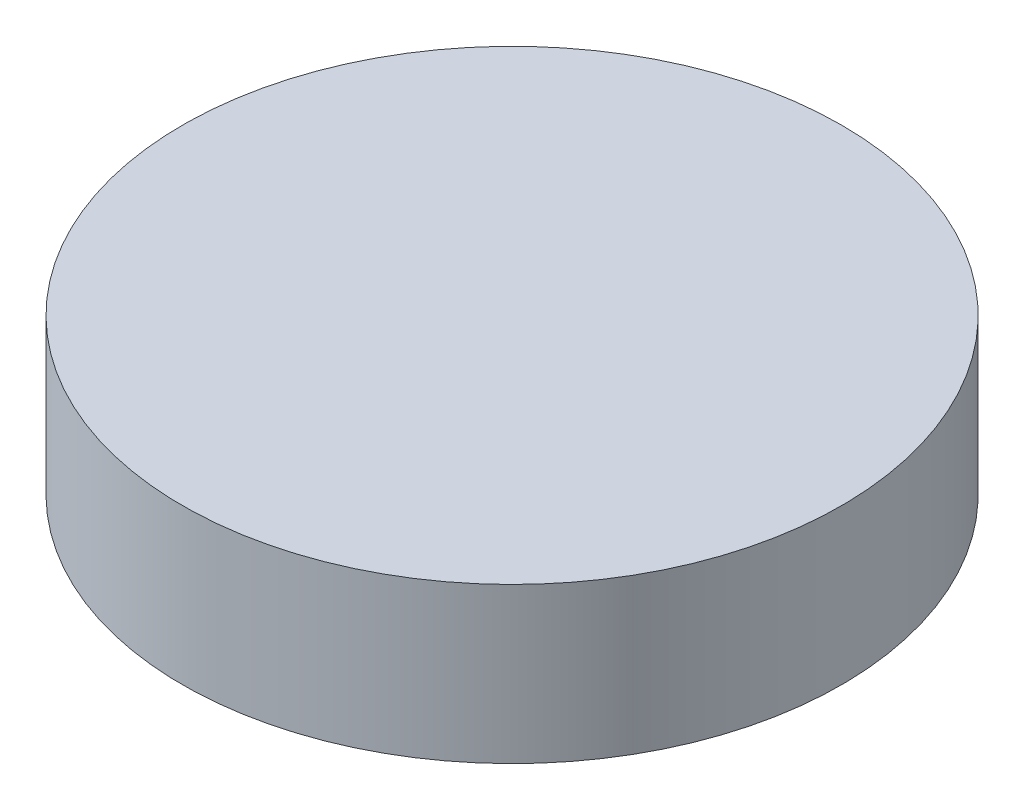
ISO-10303-21;
HEADER;
FILE_DESCRIPTION(('STEP AP214'),'2;1');
FILE_NAME('part.step','',(''),(''),'','','');
FILE_SCHEMA(('AUTOMOTIVE_DESIGN { 1 0 10303 214 1 1 1 1 }'));
ENDSEC;
DATA;
#1=APPLICATION_CONTEXT('core data for automotive mechanical design processes');
#2=APPLICATION_PROTOCOL_DEFINITION('international standard','automotive_design',2000,#1);
#3=PRODUCT_CONTEXT('',#1,'mechanical');
#4=PRODUCT('Part','Part','',(#3));
#5=PRODUCT_RELATED_PRODUCT_CATEGORY('part','',(#4));
#6=PRODUCT_DEFINITION_FORMATION('','',#4);
#7=PRODUCT_DEFINITION_CONTEXT('part definition',#1,'design');
#8=PRODUCT_DEFINITION('design','',#6,#7);
#9=PRODUCT_DEFINITION_SHAPE('','',#8);
#10=(LENGTH_UNIT() NAMED_UNIT(*) SI_UNIT(.MILLI.,.METRE.));
#11=(NAMED_UNIT(*) PLANE_ANGLE_UNIT() SI_UNIT($,.RADIAN.));
#12=(NAMED_UNIT(*) SI_UNIT($,.STERADIAN.) SOLID_ANGLE_UNIT());
#13=UNCERTAINTY_MEASURE_WITH_UNIT(LENGTH_MEASURE(1.E-05),#10,'distance_accuracy_value','');
#14=(GEOMETRIC_REPRESENTATION_CONTEXT(3) GLOBAL_UNCERTAINTY_ASSIGNED_CONTEXT((#13)) GLOBAL_UNIT_ASSIGNED_CONTEXT((#10,
#11,#12)) REPRESENTATION_CONTEXT('',''));
#15=CARTESIAN_POINT('',(0.,0.,0.));
#16=DIRECTION('',(0.,0.,1.));
#17=DIRECTION('',(1.,0.,0.));
#18=AXIS2_PLACEMENT_3D('',#15,#16,#17);
#19=CARTESIAN_POINT('',(0.,378.,0.));
#20=DIRECTION('',(0.,-1.,0.));
#21=DIRECTION('',(0.,0.,-1.));
#22=AXIS2_PLACEMENT_3D('',#19,#20,#21);
#23=PLANE('',#22);
#24=CARTESIAN_POINT('',(0.,378.,0.));
#25=DIRECTION('',(0.,-1.,0.));
#26=DIRECTION('',(0.,0.,-1.));
#27=AXIS2_PLACEMENT_3D('',#24,#25,#26);
#28=CIRCLE('',#27,565.);
#29=CARTESIAN_POINT('',(0.,378.,-565.));
#30=VERTEX_POINT('',#29);
#31=EDGE_CURVE('E10',#30,#30,#28,.T.);
#32=ORIENTED_EDGE('',*,*,#31,.F.);
#33=EDGE_LOOP('',(#32));
#34=FACE_BOUND('',#33,.T.);
#35=ADVANCED_FACE('F33',(#34),#23,.F.);
#36=CARTESIAN_POINT('',(0.,0.,0.));
#37=DIRECTION('',(0.,-1.,0.));
#38=DIRECTION('',(0.,0.,-1.));
#39=AXIS2_PLACEMENT_3D('',#36,#37,#38);
#40=CYLINDRICAL_SURFACE('',#39,565.);
#41=CARTESIAN_POINT('',(0.,112.,0.));
#42=DIRECTION('',(0.,-1.,0.));
#43=DIRECTION('',(0.,0.,-1.));
#44=AXIS2_PLACEMENT_3D('',#41,#42,#43);
#45=CIRCLE('',#44,565.);
#46=CARTESIAN_POINT('',(0.,112.,-565.));
#47=VERTEX_POINT('',#46);
#48=EDGE_CURVE('E39',#47,#47,#45,.T.);
#49=ORIENTED_EDGE('',*,*,#48,.F.);
#50=EDGE_LOOP('',(#49));
#51=FACE_BOUND('',#50,.T.);
#52=ORIENTED_EDGE('',*,*,#31,.T.);
#53=EDGE_LOOP('',(#52));
#54=FACE_BOUND('',#53,.T.);
#55=ADVANCED_FACE('F54',(#51,#54),#40,.T.);
#56=CARTESIAN_POINT('',(0.,112.,0.));
#57=DIRECTION('',(0.,1.,0.));
#58=DIRECTION('',(0.,0.,1.));
#59=AXIS2_PLACEMENT_3D('',#56,#57,#58);
#60=CONICAL_SURFACE('',#59,565.,1.07076631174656);
#61=CARTESIAN_POINT('',(0.,0.,0.));
#62=DIRECTION('',(0.,-1.,0.));
#63=DIRECTION('',(0.,0.,-1.));
#64=AXIS2_PLACEMENT_3D('',#61,#62,#63);
#65=CIRCLE('',#64,360.);
#66=CARTESIAN_POINT('',(0.,0.,-360.));
#67=VERTEX_POINT('',#66);
#68=EDGE_CURVE('E43',#67,#67,#65,.T.);
#69=ORIENTED_EDGE('',*,*,#68,.F.);
#70=EDGE_LOOP('',(#69));
#71=FACE_BOUND('',#70,.T.);
#72=ORIENTED_EDGE('',*,*,#48,.T.);
#73=EDGE_LOOP('',(#72));
#74=FACE_BOUND('',#73,.T.);
#75=ADVANCED_FACE('F52',(#71,#74),#60,.T.);
#76=CARTESIAN_POINT('',(-360.,0.,0.));
#77=DIRECTION('',(0.,1.,0.));
#78=DIRECTION('',(0.,0.,1.));
#79=AXIS2_PLACEMENT_3D('',#76,#77,#78);
#80=PLANE('',#79);
#81=ORIENTED_EDGE('',*,*,#68,.T.);
#82=EDGE_LOOP('',(#81));
#83=FACE_BOUND('',#82,.T.);
#84=ADVANCED_FACE('F50',(#83),#80,.F.);
#85=CLOSED_SHELL('',(#35,#55,#75,#84));
#86=MANIFOLD_SOLID_BREP('B2',#85);
#87=ADVANCED_BREP_SHAPE_REPRESENTATION('',(#18,#86),#14);
#88=SHAPE_DEFINITION_REPRESENTATION(#9,#87);
ENDSEC;
END-ISO-10303-21;
